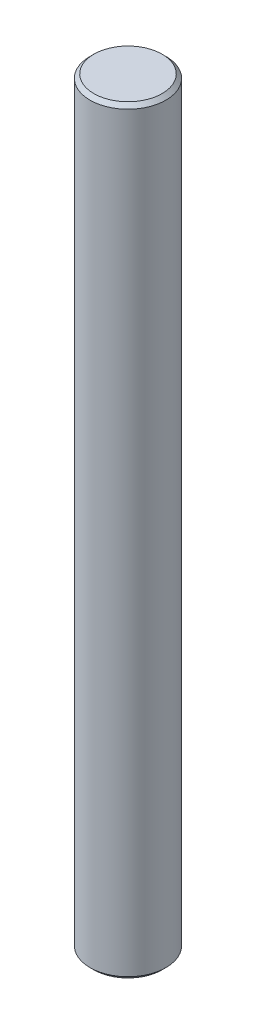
from build123d import *

# Parameters (mm, degrees)
SKETCH_1_R      = 1
EXTRUDE_1_DEPTH = 20
CHAMFER_1_SIZE  = 0.1


with BuildPart() as part:
    # Sketch 1 → Extrude 1 (new body)
    with BuildSketch(Plane(origin=(0, 0, 0), x_dir=(1, 0, 0), z_dir=(0, 1, 0))):
        with Locations(Location((0, 0, 0), (0, 0, 270))):
            Circle(SKETCH_1_R)
    extrude(amount=EXTRUDE_1_DEPTH)

    # Chamfer 1
    chamfer_1_edges = [part.edges().sort_by_distance(p)[0] for p in [
        (0, 0, -1),
        (0, 20, -1),
    ]]
    chamfer(chamfer_1_edges, length=CHAMFER_1_SIZE)


solid = part.part
